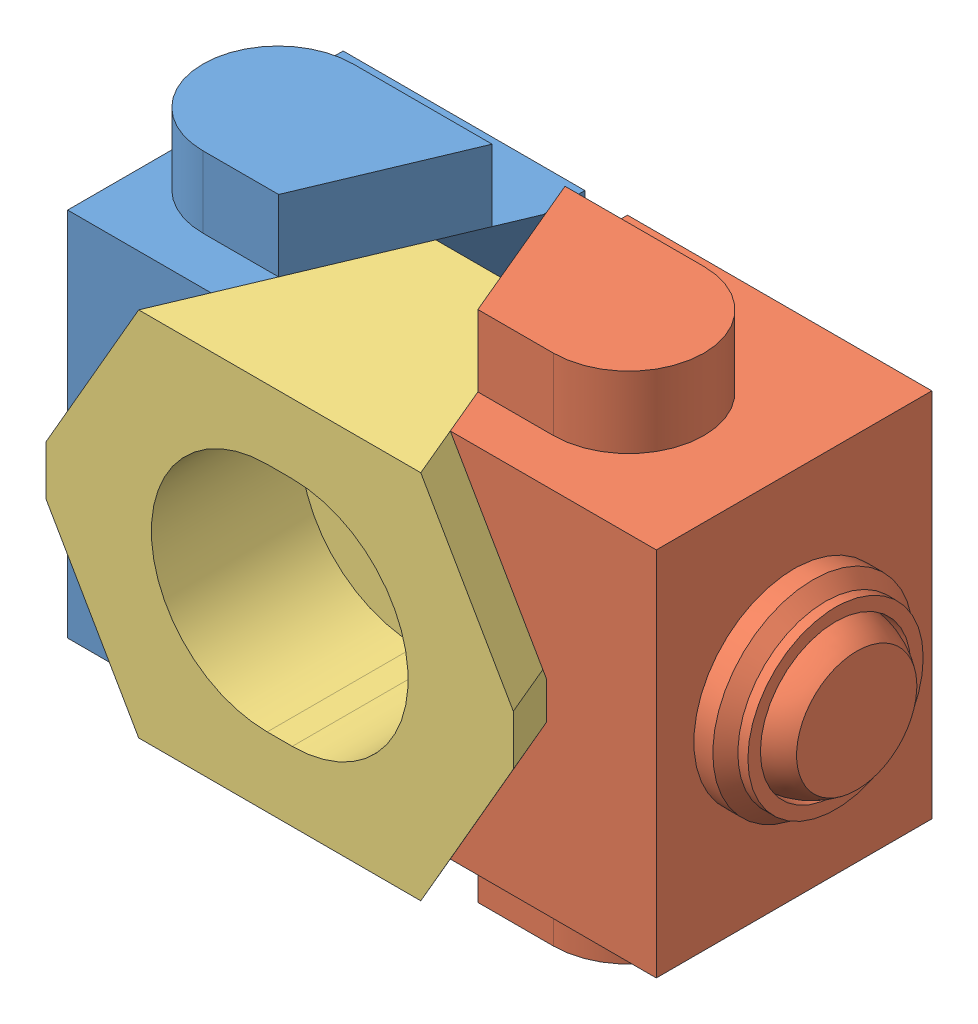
SolidWorks assembly DK2-VT-SP.sldasm, configuration Default (file format 15000). Lengths in mm.
Overall size (52 41 26.07).
3 component instances, 3 part files, 0 mates.
Components (placement in the parent):
- DK2-VT-SP_01-1: DK2-VT-SP_01.SLDPRT [Default] at (-21 0 0) size (19.3 41 22)
- DK2-VT-SP_02-1: DK2-VT-SP_02.SLDPRT [Default] at (26 0 0) x (-1 0 0) z (0 0 1) size (29.3 41 22)
- DK2-VT-SP_03-1: DK2-VT-SP_03.SLDPRT [Default] at (0 0 9.3653) x (-1 0 0) z (0 0 1) size (37.3 29.6 16.7)
